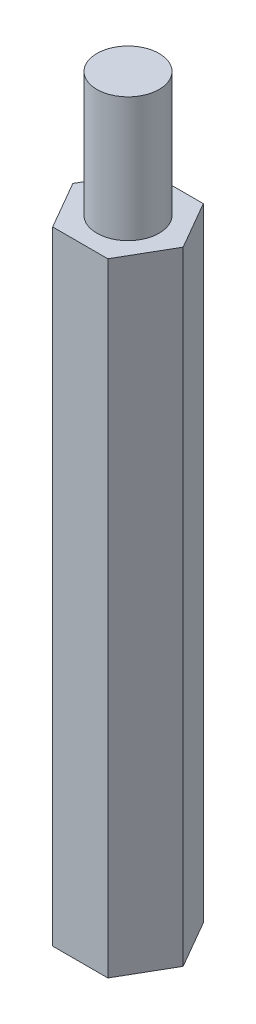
ISO-10303-21;
HEADER;
FILE_DESCRIPTION(('STEP AP214'),'2;1');
FILE_NAME('part.step','',(''),(''),'','','');
FILE_SCHEMA(('AUTOMOTIVE_DESIGN { 1 0 10303 214 1 1 1 1 }'));
ENDSEC;
DATA;
#1=APPLICATION_CONTEXT('core data for automotive mechanical design processes');
#2=APPLICATION_PROTOCOL_DEFINITION('international standard','automotive_design',2000,#1);
#3=PRODUCT_CONTEXT('',#1,'mechanical');
#4=PRODUCT('Part','Part','',(#3));
#5=PRODUCT_RELATED_PRODUCT_CATEGORY('part','',(#4));
#6=PRODUCT_DEFINITION_FORMATION('','',#4);
#7=PRODUCT_DEFINITION_CONTEXT('part definition',#1,'design');
#8=PRODUCT_DEFINITION('design','',#6,#7);
#9=PRODUCT_DEFINITION_SHAPE('','',#8);
#10=(LENGTH_UNIT() NAMED_UNIT(*) SI_UNIT(.MILLI.,.METRE.));
#11=(NAMED_UNIT(*) PLANE_ANGLE_UNIT() SI_UNIT($,.RADIAN.));
#12=(NAMED_UNIT(*) SI_UNIT($,.STERADIAN.) SOLID_ANGLE_UNIT());
#13=UNCERTAINTY_MEASURE_WITH_UNIT(LENGTH_MEASURE(1.E-05),#10,'distance_accuracy_value','');
#14=(GEOMETRIC_REPRESENTATION_CONTEXT(3) GLOBAL_UNCERTAINTY_ASSIGNED_CONTEXT((#13)) GLOBAL_UNIT_ASSIGNED_CONTEXT((#10,
#11,#12)) REPRESENTATION_CONTEXT('',''));
#15=CARTESIAN_POINT('',(0.,0.,0.));
#16=DIRECTION('',(0.,0.,1.));
#17=DIRECTION('',(1.,0.,0.));
#18=AXIS2_PLACEMENT_3D('',#15,#16,#17);
#19=CARTESIAN_POINT('',(1.32790561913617,30.,2.29999999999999));
#20=DIRECTION('',(-0.866025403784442,0.,-0.499999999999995));
#21=DIRECTION('',(-0.499999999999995,0.,0.866025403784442));
#22=AXIS2_PLACEMENT_3D('',#19,#20,#21);
#23=PLANE('',#22);
#24=DIRECTION('',(0.499999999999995,0.,-0.866025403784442));
#25=VECTOR('',#24,1.);
#26=CARTESIAN_POINT('',(1.32790561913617,0.,2.29999999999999));
#27=LINE('',#26,#25);
#28=CARTESIAN_POINT('',(1.32790561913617,0.,2.29999999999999));
#29=VERTEX_POINT('',#28);
#30=CARTESIAN_POINT('',(2.65581123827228,0.,0.));
#31=VERTEX_POINT('',#30);
#32=EDGE_CURVE('E126',#29,#31,#27,.T.);
#33=ORIENTED_EDGE('',*,*,#32,.T.);
#34=DIRECTION('',(0.,-1.,0.));
#35=VECTOR('',#34,1.);
#36=CARTESIAN_POINT('',(2.65581123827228,30.,0.));
#37=LINE('',#36,#35);
#38=CARTESIAN_POINT('',(2.65581123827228,30.,0.));
#39=VERTEX_POINT('',#38);
#40=EDGE_CURVE('E46',#39,#31,#37,.T.);
#41=ORIENTED_EDGE('',*,*,#40,.F.);
#42=DIRECTION('',(0.499999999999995,0.,-0.866025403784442));
#43=VECTOR('',#42,1.);
#44=CARTESIAN_POINT('',(1.32790561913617,30.,2.29999999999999));
#45=LINE('',#44,#43);
#46=CARTESIAN_POINT('',(1.32790561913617,30.,2.29999999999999));
#47=VERTEX_POINT('',#46);
#48=EDGE_CURVE('E140',#47,#39,#45,.T.);
#49=ORIENTED_EDGE('',*,*,#48,.F.);
#50=DIRECTION('',(0.,-1.,0.));
#51=VECTOR('',#50,1.);
#52=CARTESIAN_POINT('',(1.32790561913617,30.,2.29999999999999));
#53=LINE('',#52,#51);
#54=EDGE_CURVE('E123',#47,#29,#53,.T.);
#55=ORIENTED_EDGE('',*,*,#54,.T.);
#56=EDGE_LOOP('',(#33,#41,#49,#55));
#57=FACE_BOUND('',#56,.T.);
#58=ADVANCED_FACE('F43',(#57),#23,.F.);
#59=CARTESIAN_POINT('',(2.65581123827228,30.,0.));
#60=DIRECTION('',(-0.866025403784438,0.,0.500000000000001));
#61=DIRECTION('',(0.500000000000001,0.,0.866025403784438));
#62=AXIS2_PLACEMENT_3D('',#59,#60,#61);
#63=PLANE('',#62);
#64=DIRECTION('',(-0.500000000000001,0.,-0.866025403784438));
#65=VECTOR('',#64,1.);
#66=CARTESIAN_POINT('',(2.65581123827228,0.,0.));
#67=LINE('',#66,#65);
#68=CARTESIAN_POINT('',(1.32790561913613,0.,-2.3));
#69=VERTEX_POINT('',#68);
#70=EDGE_CURVE('E131',#31,#69,#67,.T.);
#71=ORIENTED_EDGE('',*,*,#70,.T.);
#72=DIRECTION('',(0.,-1.,0.));
#73=VECTOR('',#72,1.);
#74=CARTESIAN_POINT('',(1.32790561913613,30.,-2.3));
#75=LINE('',#74,#73);
#76=CARTESIAN_POINT('',(1.32790561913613,30.,-2.3));
#77=VERTEX_POINT('',#76);
#78=EDGE_CURVE('E141',#77,#69,#75,.T.);
#79=ORIENTED_EDGE('',*,*,#78,.F.);
#80=DIRECTION('',(-0.500000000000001,0.,-0.866025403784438));
#81=VECTOR('',#80,1.);
#82=CARTESIAN_POINT('',(2.65581123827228,30.,0.));
#83=LINE('',#82,#81);
#84=EDGE_CURVE('E96',#39,#77,#83,.T.);
#85=ORIENTED_EDGE('',*,*,#84,.F.);
#86=ORIENTED_EDGE('',*,*,#40,.T.);
#87=EDGE_LOOP('',(#71,#79,#85,#86));
#88=FACE_BOUND('',#87,.T.);
#89=ADVANCED_FACE('F149',(#88),#63,.F.);
#90=CARTESIAN_POINT('',(1.32790561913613,30.,-2.3));
#91=DIRECTION('',(0.,0.,1.));
#92=DIRECTION('',(1.,0.,0.));
#93=AXIS2_PLACEMENT_3D('',#90,#91,#92);
#94=PLANE('',#93);
#95=DIRECTION('',(-1.,0.,0.));
#96=VECTOR('',#95,1.);
#97=CARTESIAN_POINT('',(1.32790561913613,0.,-2.3));
#98=LINE('',#97,#96);
#99=CARTESIAN_POINT('',(-1.32790561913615,0.,-2.3));
#100=VERTEX_POINT('',#99);
#101=EDGE_CURVE('E132',#69,#100,#98,.T.);
#102=ORIENTED_EDGE('',*,*,#101,.T.);
#103=DIRECTION('',(0.,-1.,0.));
#104=VECTOR('',#103,1.);
#105=CARTESIAN_POINT('',(-1.32790561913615,30.,-2.3));
#106=LINE('',#105,#104);
#107=CARTESIAN_POINT('',(-1.32790561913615,30.,-2.3));
#108=VERTEX_POINT('',#107);
#109=EDGE_CURVE('E119',#108,#100,#106,.T.);
#110=ORIENTED_EDGE('',*,*,#109,.F.);
#111=DIRECTION('',(-1.,0.,0.));
#112=VECTOR('',#111,1.);
#113=CARTESIAN_POINT('',(1.32790561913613,30.,-2.3));
#114=LINE('',#113,#112);
#115=EDGE_CURVE('E111',#77,#108,#114,.T.);
#116=ORIENTED_EDGE('',*,*,#115,.F.);
#117=ORIENTED_EDGE('',*,*,#78,.T.);
#118=EDGE_LOOP('',(#102,#110,#116,#117));
#119=FACE_BOUND('',#118,.T.);
#120=ADVANCED_FACE('F153',(#119),#94,.F.);
#121=CARTESIAN_POINT('',(-1.32790561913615,30.,-2.3));
#122=DIRECTION('',(0.866025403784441,0.,0.499999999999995));
#123=DIRECTION('',(0.499999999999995,0.,-0.866025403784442));
#124=AXIS2_PLACEMENT_3D('',#121,#122,#123);
#125=PLANE('',#124);
#126=DIRECTION('',(-0.499999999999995,0.,0.866025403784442));
#127=VECTOR('',#126,1.);
#128=CARTESIAN_POINT('',(-1.32790561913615,0.,-2.3));
#129=LINE('',#128,#127);
#130=CARTESIAN_POINT('',(-2.65581123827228,0.,0.));
#131=VERTEX_POINT('',#130);
#132=EDGE_CURVE('E118',#100,#131,#129,.T.);
#133=ORIENTED_EDGE('',*,*,#132,.T.);
#134=DIRECTION('',(0.,-1.,0.));
#135=VECTOR('',#134,1.);
#136=CARTESIAN_POINT('',(-2.65581123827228,30.,0.));
#137=LINE('',#136,#135);
#138=CARTESIAN_POINT('',(-2.65581123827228,30.,0.));
#139=VERTEX_POINT('',#138);
#140=EDGE_CURVE('E116',#139,#131,#137,.T.);
#141=ORIENTED_EDGE('',*,*,#140,.F.);
#142=DIRECTION('',(-0.499999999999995,0.,0.866025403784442));
#143=VECTOR('',#142,1.);
#144=CARTESIAN_POINT('',(-1.32790561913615,30.,-2.3));
#145=LINE('',#144,#143);
#146=EDGE_CURVE('E102',#108,#139,#145,.T.);
#147=ORIENTED_EDGE('',*,*,#146,.F.);
#148=ORIENTED_EDGE('',*,*,#109,.T.);
#149=EDGE_LOOP('',(#133,#141,#147,#148));
#150=FACE_BOUND('',#149,.T.);
#151=ADVANCED_FACE('F120',(#150),#125,.F.);
#152=CARTESIAN_POINT('',(-2.65581123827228,30.,0.));
#153=DIRECTION('',(0.866025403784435,0.,-0.500000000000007));
#154=DIRECTION('',(-0.500000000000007,0.,-0.866025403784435));
#155=AXIS2_PLACEMENT_3D('',#152,#153,#154);
#156=PLANE('',#155);
#157=DIRECTION('',(0.500000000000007,0.,0.866025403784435));
#158=VECTOR('',#157,1.);
#159=CARTESIAN_POINT('',(-2.65581123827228,0.,0.));
#160=LINE('',#159,#158);
#161=CARTESIAN_POINT('',(-1.32790561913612,0.,2.30000000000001));
#162=VERTEX_POINT('',#161);
#163=EDGE_CURVE('E84',#131,#162,#160,.T.);
#164=ORIENTED_EDGE('',*,*,#163,.T.);
#165=DIRECTION('',(0.,-1.,0.));
#166=VECTOR('',#165,1.);
#167=CARTESIAN_POINT('',(-1.32790561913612,30.,2.30000000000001));
#168=LINE('',#167,#166);
#169=CARTESIAN_POINT('',(-1.32790561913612,30.,2.30000000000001));
#170=VERTEX_POINT('',#169);
#171=EDGE_CURVE('E122',#170,#162,#168,.T.);
#172=ORIENTED_EDGE('',*,*,#171,.F.);
#173=DIRECTION('',(0.500000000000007,0.,0.866025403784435));
#174=VECTOR('',#173,1.);
#175=CARTESIAN_POINT('',(-2.65581123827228,30.,0.));
#176=LINE('',#175,#174);
#177=EDGE_CURVE('E107',#139,#170,#176,.T.);
#178=ORIENTED_EDGE('',*,*,#177,.F.);
#179=ORIENTED_EDGE('',*,*,#140,.T.);
#180=EDGE_LOOP('',(#164,#172,#178,#179));
#181=FACE_BOUND('',#180,.T.);
#182=ADVANCED_FACE('F124',(#181),#156,.F.);
#183=CARTESIAN_POINT('',(-1.32790561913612,30.,2.30000000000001));
#184=DIRECTION('',(0.,0.,-1.));
#185=DIRECTION('',(-1.,0.,0.));
#186=AXIS2_PLACEMENT_3D('',#183,#184,#185);
#187=PLANE('',#186);
#188=DIRECTION('',(1.,0.,0.));
#189=VECTOR('',#188,1.);
#190=CARTESIAN_POINT('',(-1.32790561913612,0.,2.30000000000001));
#191=LINE('',#190,#189);
#192=EDGE_CURVE('E88',#162,#29,#191,.T.);
#193=ORIENTED_EDGE('',*,*,#192,.T.);
#194=ORIENTED_EDGE('',*,*,#54,.F.);
#195=DIRECTION('',(1.,0.,0.));
#196=VECTOR('',#195,1.);
#197=CARTESIAN_POINT('',(-1.32790561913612,30.,2.30000000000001));
#198=LINE('',#197,#196);
#199=EDGE_CURVE('E58',#170,#47,#198,.T.);
#200=ORIENTED_EDGE('',*,*,#199,.F.);
#201=ORIENTED_EDGE('',*,*,#171,.T.);
#202=EDGE_LOOP('',(#193,#194,#200,#201));
#203=FACE_BOUND('',#202,.T.);
#204=ADVANCED_FACE('F190',(#203),#187,.F.);
#205=CARTESIAN_POINT('',(0.,30.,0.));
#206=DIRECTION('',(0.,1.,0.));
#207=DIRECTION('',(0.,0.,1.));
#208=AXIS2_PLACEMENT_3D('',#205,#206,#207);
#209=PLANE('',#208);
#210=CARTESIAN_POINT('',(0.,30.,0.));
#211=DIRECTION('',(0.,1.,0.));
#212=DIRECTION('',(0.,0.,1.));
#213=AXIS2_PLACEMENT_3D('',#210,#211,#212);
#214=CIRCLE('',#213,1.5);
#215=CARTESIAN_POINT('',(0.,30.,1.5));
#216=VERTEX_POINT('',#215);
#217=EDGE_CURVE('E11',#216,#216,#214,.T.);
#218=ORIENTED_EDGE('',*,*,#217,.F.);
#219=EDGE_LOOP('',(#218));
#220=FACE_BOUND('',#219,.T.);
#221=ORIENTED_EDGE('',*,*,#48,.T.);
#222=ORIENTED_EDGE('',*,*,#84,.T.);
#223=ORIENTED_EDGE('',*,*,#115,.T.);
#224=ORIENTED_EDGE('',*,*,#146,.T.);
#225=ORIENTED_EDGE('',*,*,#177,.T.);
#226=ORIENTED_EDGE('',*,*,#199,.T.);
#227=EDGE_LOOP('',(#221,#222,#223,#224,#225,#226));
#228=FACE_BOUND('',#227,.T.);
#229=ADVANCED_FACE('F110',(#220,#228),#209,.T.);
#230=CARTESIAN_POINT('',(0.,0.,0.));
#231=DIRECTION('',(0.,1.,0.));
#232=DIRECTION('',(0.,0.,1.));
#233=AXIS2_PLACEMENT_3D('',#230,#231,#232);
#234=PLANE('',#233);
#235=CARTESIAN_POINT('',(0.,0.,0.));
#236=DIRECTION('',(0.,-1.,0.));
#237=DIRECTION('',(0.,0.,-1.));
#238=AXIS2_PLACEMENT_3D('',#235,#236,#237);
#239=CIRCLE('',#238,1.5);
#240=CARTESIAN_POINT('',(0.,0.,-1.5));
#241=VERTEX_POINT('',#240);
#242=EDGE_CURVE('E163',#241,#241,#239,.T.);
#243=ORIENTED_EDGE('',*,*,#242,.F.);
#244=EDGE_LOOP('',(#243));
#245=FACE_BOUND('',#244,.T.);
#246=ORIENTED_EDGE('',*,*,#32,.F.);
#247=ORIENTED_EDGE('',*,*,#192,.F.);
#248=ORIENTED_EDGE('',*,*,#163,.F.);
#249=ORIENTED_EDGE('',*,*,#132,.F.);
#250=ORIENTED_EDGE('',*,*,#101,.F.);
#251=ORIENTED_EDGE('',*,*,#70,.F.);
#252=EDGE_LOOP('',(#246,#247,#248,#249,#250,#251));
#253=FACE_BOUND('',#252,.T.);
#254=ADVANCED_FACE('F155',(#245,#253),#234,.F.);
#255=CARTESIAN_POINT('',(0.,36.,0.));
#256=DIRECTION('',(0.,-1.,0.));
#257=DIRECTION('',(0.,0.,-1.));
#258=AXIS2_PLACEMENT_3D('',#255,#256,#257);
#259=CYLINDRICAL_SURFACE('',#258,1.5);
#260=CARTESIAN_POINT('',(0.,36.,0.));
#261=DIRECTION('',(0.,1.,0.));
#262=DIRECTION('',(0.,0.,1.));
#263=AXIS2_PLACEMENT_3D('',#260,#261,#262);
#264=CIRCLE('',#263,1.5);
#265=CARTESIAN_POINT('',(0.,36.,1.5));
#266=VERTEX_POINT('',#265);
#267=EDGE_CURVE('E135',#266,#266,#264,.T.);
#268=ORIENTED_EDGE('',*,*,#267,.F.);
#269=EDGE_LOOP('',(#268));
#270=FACE_BOUND('',#269,.T.);
#271=ORIENTED_EDGE('',*,*,#217,.T.);
#272=EDGE_LOOP('',(#271));
#273=FACE_BOUND('',#272,.T.);
#274=ADVANCED_FACE('F180',(#270,#273),#259,.T.);
#275=CARTESIAN_POINT('',(0.,36.,0.));
#276=DIRECTION('',(0.,1.,0.));
#277=DIRECTION('',(0.,0.,1.));
#278=AXIS2_PLACEMENT_3D('',#275,#276,#277);
#279=PLANE('',#278);
#280=ORIENTED_EDGE('',*,*,#267,.T.);
#281=EDGE_LOOP('',(#280));
#282=FACE_BOUND('',#281,.T.);
#283=ADVANCED_FACE('F175',(#282),#279,.T.);
#284=CARTESIAN_POINT('',(0.,10.,0.));
#285=DIRECTION('',(0.,-1.,0.));
#286=DIRECTION('',(0.,0.,-1.));
#287=AXIS2_PLACEMENT_3D('',#284,#285,#286);
#288=CYLINDRICAL_SURFACE('',#287,1.5);
#289=CARTESIAN_POINT('',(0.,10.,0.));
#290=DIRECTION('',(0.,-1.,0.));
#291=DIRECTION('',(0.,0.,-1.));
#292=AXIS2_PLACEMENT_3D('',#289,#290,#291);
#293=CIRCLE('',#292,1.5);
#294=CARTESIAN_POINT('',(0.,10.,-1.5));
#295=VERTEX_POINT('',#294);
#296=EDGE_CURVE('E160',#295,#295,#293,.T.);
#297=ORIENTED_EDGE('',*,*,#296,.F.);
#298=EDGE_LOOP('',(#297));
#299=FACE_BOUND('',#298,.T.);
#300=ORIENTED_EDGE('',*,*,#242,.T.);
#301=EDGE_LOOP('',(#300));
#302=FACE_BOUND('',#301,.T.);
#303=ADVANCED_FACE('F169',(#299,#302),#288,.F.);
#304=CARTESIAN_POINT('',(0.,10.,0.));
#305=DIRECTION('',(0.,-1.,0.));
#306=DIRECTION('',(0.,0.,-1.));
#307=AXIS2_PLACEMENT_3D('',#304,#305,#306);
#308=PLANE('',#307);
#309=ORIENTED_EDGE('',*,*,#296,.T.);
#310=EDGE_LOOP('',(#309));
#311=FACE_BOUND('',#310,.T.);
#312=ADVANCED_FACE('F170',(#311),#308,.T.);
#313=CLOSED_SHELL('',(#58,#89,#120,#151,#182,#204,#229,#254,#274,#283,#303,#312));
#314=MANIFOLD_SOLID_BREP('B2',#313);
#315=ADVANCED_BREP_SHAPE_REPRESENTATION('',(#18,#314),#14);
#316=SHAPE_DEFINITION_REPRESENTATION(#9,#315);
ENDSEC;
END-ISO-10303-21;
